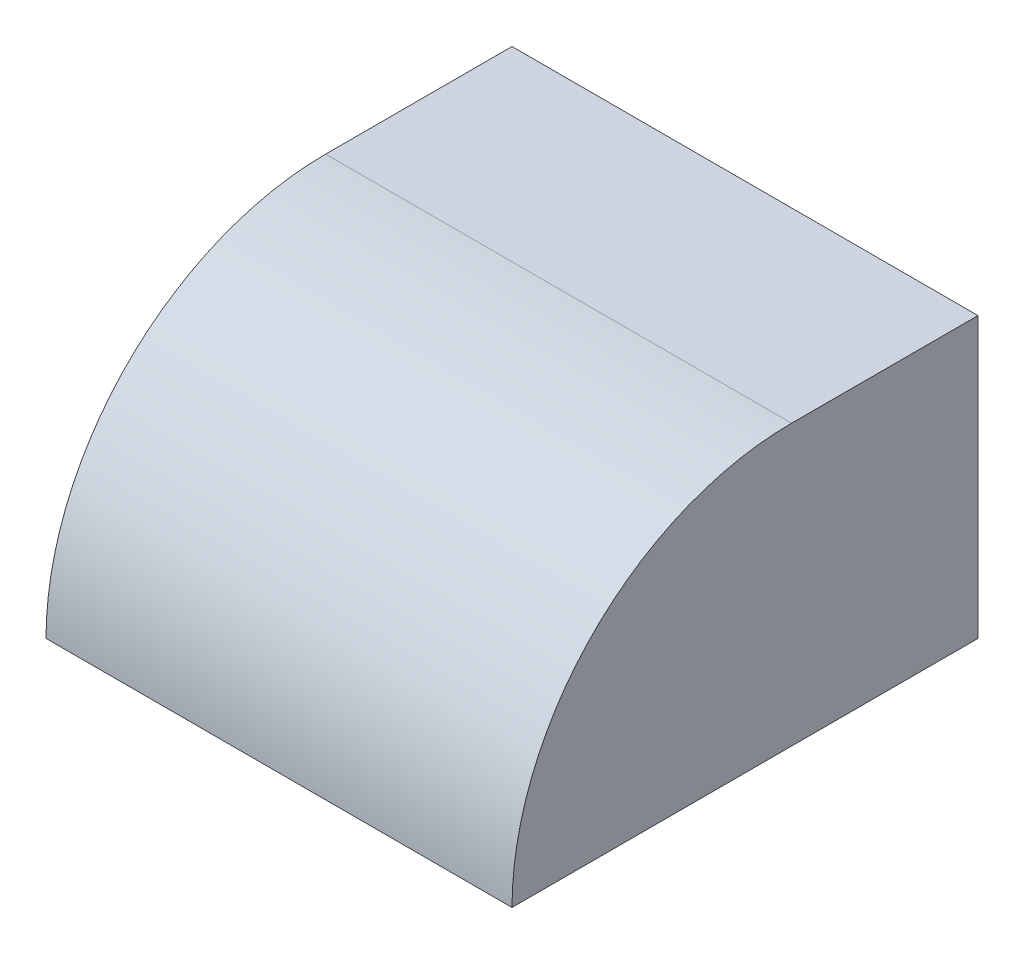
ISO-10303-21;
HEADER;
FILE_DESCRIPTION(('STEP AP214'),'2;1');
FILE_NAME('part.step','',(''),(''),'','','');
FILE_SCHEMA(('AUTOMOTIVE_DESIGN { 1 0 10303 214 1 1 1 1 }'));
ENDSEC;
DATA;
#1=APPLICATION_CONTEXT('core data for automotive mechanical design processes');
#2=APPLICATION_PROTOCOL_DEFINITION('international standard','automotive_design',2000,#1);
#3=PRODUCT_CONTEXT('',#1,'mechanical');
#4=PRODUCT('Part','Part','',(#3));
#5=PRODUCT_RELATED_PRODUCT_CATEGORY('part','',(#4));
#6=PRODUCT_DEFINITION_FORMATION('','',#4);
#7=PRODUCT_DEFINITION_CONTEXT('part definition',#1,'design');
#8=PRODUCT_DEFINITION('design','',#6,#7);
#9=PRODUCT_DEFINITION_SHAPE('','',#8);
#10=(LENGTH_UNIT() NAMED_UNIT(*) SI_UNIT(.MILLI.,.METRE.));
#11=(NAMED_UNIT(*) PLANE_ANGLE_UNIT() SI_UNIT($,.RADIAN.));
#12=(NAMED_UNIT(*) SI_UNIT($,.STERADIAN.) SOLID_ANGLE_UNIT());
#13=UNCERTAINTY_MEASURE_WITH_UNIT(LENGTH_MEASURE(1.E-05),#10,'distance_accuracy_value','');
#14=(GEOMETRIC_REPRESENTATION_CONTEXT(3) GLOBAL_UNCERTAINTY_ASSIGNED_CONTEXT((#13)) GLOBAL_UNIT_ASSIGNED_CONTEXT((#10,
#11,#12)) REPRESENTATION_CONTEXT('',''));
#15=CARTESIAN_POINT('',(0.,0.,0.));
#16=DIRECTION('',(0.,0.,1.));
#17=DIRECTION('',(1.,0.,0.));
#18=AXIS2_PLACEMENT_3D('',#15,#16,#17);
#19=CARTESIAN_POINT('',(0.,30.,50.));
#20=DIRECTION('',(0.,-1.,0.));
#21=DIRECTION('',(0.,0.,-1.));
#22=AXIS2_PLACEMENT_3D('',#19,#20,#21);
#23=PLANE('',#22);
#24=DIRECTION('',(0.,0.,-1.));
#25=VECTOR('',#24,1.);
#26=CARTESIAN_POINT('',(0.,30.,50.));
#27=LINE('',#26,#25);
#28=CARTESIAN_POINT('',(0.,30.,20.));
#29=VERTEX_POINT('',#28);
#30=CARTESIAN_POINT('',(0.,30.,0.));
#31=VERTEX_POINT('',#30);
#32=EDGE_CURVE('E91',#29,#31,#27,.T.);
#33=ORIENTED_EDGE('',*,*,#32,.F.);
#34=DIRECTION('',(-1.,0.,0.));
#35=VECTOR('',#34,1.);
#36=CARTESIAN_POINT('',(0.,30.,20.));
#37=LINE('',#36,#35);
#38=CARTESIAN_POINT('',(50.,30.,20.));
#39=VERTEX_POINT('',#38);
#40=EDGE_CURVE('E41',#29,#39,#37,.F.);
#41=ORIENTED_EDGE('',*,*,#40,.T.);
#42=DIRECTION('',(0.,0.,-1.));
#43=VECTOR('',#42,1.);
#44=CARTESIAN_POINT('',(50.,30.,50.));
#45=LINE('',#44,#43);
#46=CARTESIAN_POINT('',(50.,30.,0.));
#47=VERTEX_POINT('',#46);
#48=EDGE_CURVE('E100',#39,#47,#45,.T.);
#49=ORIENTED_EDGE('',*,*,#48,.T.);
#50=DIRECTION('',(-1.,0.,0.));
#51=VECTOR('',#50,1.);
#52=CARTESIAN_POINT('',(0.,30.,0.));
#53=LINE('',#52,#51);
#54=EDGE_CURVE('E96',#47,#31,#53,.T.);
#55=ORIENTED_EDGE('',*,*,#54,.T.);
#56=EDGE_LOOP('',(#33,#41,#49,#55));
#57=FACE_BOUND('',#56,.T.);
#58=ADVANCED_FACE('F33',(#57),#23,.F.);
#59=CARTESIAN_POINT('',(0.,0.,50.));
#60=DIRECTION('',(1.,0.,0.));
#61=DIRECTION('',(0.,0.,-1.));
#62=AXIS2_PLACEMENT_3D('',#59,#60,#61);
#63=PLANE('',#62);
#64=DIRECTION('',(0.,0.,-1.));
#65=VECTOR('',#64,1.);
#66=CARTESIAN_POINT('',(0.,0.,50.));
#67=LINE('',#66,#65);
#68=CARTESIAN_POINT('',(0.,0.,50.));
#69=VERTEX_POINT('',#68);
#70=CARTESIAN_POINT('',(0.,0.,0.));
#71=VERTEX_POINT('',#70);
#72=EDGE_CURVE('E85',#69,#71,#67,.T.);
#73=ORIENTED_EDGE('',*,*,#72,.F.);
#74=CARTESIAN_POINT('',(0.,0.,20.));
#75=DIRECTION('',(1.,0.,0.));
#76=DIRECTION('',(0.,0.,-1.));
#77=AXIS2_PLACEMENT_3D('',#74,#75,#76);
#78=CIRCLE('',#77,30.);
#79=EDGE_CURVE('E55',#69,#29,#78,.F.);
#80=ORIENTED_EDGE('',*,*,#79,.T.);
#81=ORIENTED_EDGE('',*,*,#32,.T.);
#82=DIRECTION('',(0.,-1.,0.));
#83=VECTOR('',#82,1.);
#84=CARTESIAN_POINT('',(0.,0.,0.));
#85=LINE('',#84,#83);
#86=EDGE_CURVE('E77',#31,#71,#85,.T.);
#87=ORIENTED_EDGE('',*,*,#86,.T.);
#88=EDGE_LOOP('',(#73,#80,#81,#87));
#89=FACE_BOUND('',#88,.T.);
#90=ADVANCED_FACE('F35',(#89),#63,.F.);
#91=CARTESIAN_POINT('',(0.,0.,50.));
#92=DIRECTION('',(0.,1.,0.));
#93=DIRECTION('',(0.,0.,1.));
#94=AXIS2_PLACEMENT_3D('',#91,#92,#93);
#95=PLANE('',#94);
#96=DIRECTION('',(1.,0.,0.));
#97=VECTOR('',#96,1.);
#98=CARTESIAN_POINT('',(0.,0.,0.));
#99=LINE('',#98,#97);
#100=CARTESIAN_POINT('',(50.,0.,0.));
#101=VERTEX_POINT('',#100);
#102=EDGE_CURVE('E72',#71,#101,#99,.T.);
#103=ORIENTED_EDGE('',*,*,#102,.T.);
#104=DIRECTION('',(0.,0.,-1.));
#105=VECTOR('',#104,1.);
#106=CARTESIAN_POINT('',(50.,0.,50.));
#107=LINE('',#106,#105);
#108=CARTESIAN_POINT('',(50.,0.,50.));
#109=VERTEX_POINT('',#108);
#110=EDGE_CURVE('E89',#109,#101,#107,.T.);
#111=ORIENTED_EDGE('',*,*,#110,.F.);
#112=DIRECTION('',(1.,0.,0.));
#113=VECTOR('',#112,1.);
#114=CARTESIAN_POINT('',(0.,0.,50.));
#115=LINE('',#114,#113);
#116=EDGE_CURVE('E88',#69,#109,#115,.T.);
#117=ORIENTED_EDGE('',*,*,#116,.F.);
#118=ORIENTED_EDGE('',*,*,#72,.T.);
#119=EDGE_LOOP('',(#103,#111,#117,#118));
#120=FACE_BOUND('',#119,.T.);
#121=ADVANCED_FACE('F86',(#120),#95,.F.);
#122=CARTESIAN_POINT('',(50.,0.,50.));
#123=DIRECTION('',(-1.,0.,0.));
#124=DIRECTION('',(0.,0.,1.));
#125=AXIS2_PLACEMENT_3D('',#122,#123,#124);
#126=PLANE('',#125);
#127=ORIENTED_EDGE('',*,*,#48,.F.);
#128=CARTESIAN_POINT('',(50.,0.,20.));
#129=DIRECTION('',(-1.,0.,0.));
#130=DIRECTION('',(0.,0.,1.));
#131=AXIS2_PLACEMENT_3D('',#128,#129,#130);
#132=CIRCLE('',#131,30.);
#133=EDGE_CURVE('E11',#39,#109,#132,.F.);
#134=ORIENTED_EDGE('',*,*,#133,.T.);
#135=ORIENTED_EDGE('',*,*,#110,.T.);
#136=DIRECTION('',(0.,1.,0.));
#137=VECTOR('',#136,1.);
#138=CARTESIAN_POINT('',(50.,0.,0.));
#139=LINE('',#138,#137);
#140=EDGE_CURVE('E79',#101,#47,#139,.T.);
#141=ORIENTED_EDGE('',*,*,#140,.T.);
#142=EDGE_LOOP('',(#127,#134,#135,#141));
#143=FACE_BOUND('',#142,.T.);
#144=ADVANCED_FACE('F104',(#143),#126,.F.);
#145=CARTESIAN_POINT('',(0.,30.,0.));
#146=DIRECTION('',(0.,0.,-1.));
#147=DIRECTION('',(-1.,0.,0.));
#148=AXIS2_PLACEMENT_3D('',#145,#146,#147);
#149=PLANE('',#148);
#150=ORIENTED_EDGE('',*,*,#86,.F.);
#151=ORIENTED_EDGE('',*,*,#54,.F.);
#152=ORIENTED_EDGE('',*,*,#140,.F.);
#153=ORIENTED_EDGE('',*,*,#102,.F.);
#154=EDGE_LOOP('',(#150,#151,#152,#153));
#155=FACE_BOUND('',#154,.T.);
#156=ADVANCED_FACE('F74',(#155),#149,.T.);
#157=CARTESIAN_POINT('',(0.,0.,20.));
#158=DIRECTION('',(-1.,0.,0.));
#159=DIRECTION('',(0.,0.,1.));
#160=AXIS2_PLACEMENT_3D('',#157,#158,#159);
#161=CYLINDRICAL_SURFACE('',#160,30.);
#162=ORIENTED_EDGE('',*,*,#133,.F.);
#163=ORIENTED_EDGE('',*,*,#40,.F.);
#164=ORIENTED_EDGE('',*,*,#79,.F.);
#165=ORIENTED_EDGE('',*,*,#116,.T.);
#166=EDGE_LOOP('',(#162,#163,#164,#165));
#167=FACE_BOUND('',#166,.T.);
#168=ADVANCED_FACE('F107',(#167),#161,.T.);
#169=CLOSED_SHELL('',(#58,#90,#121,#144,#156,#168));
#170=MANIFOLD_SOLID_BREP('B2',#169);
#171=ADVANCED_BREP_SHAPE_REPRESENTATION('',(#18,#170),#14);
#172=SHAPE_DEFINITION_REPRESENTATION(#9,#171);
ENDSEC;
END-ISO-10303-21;
